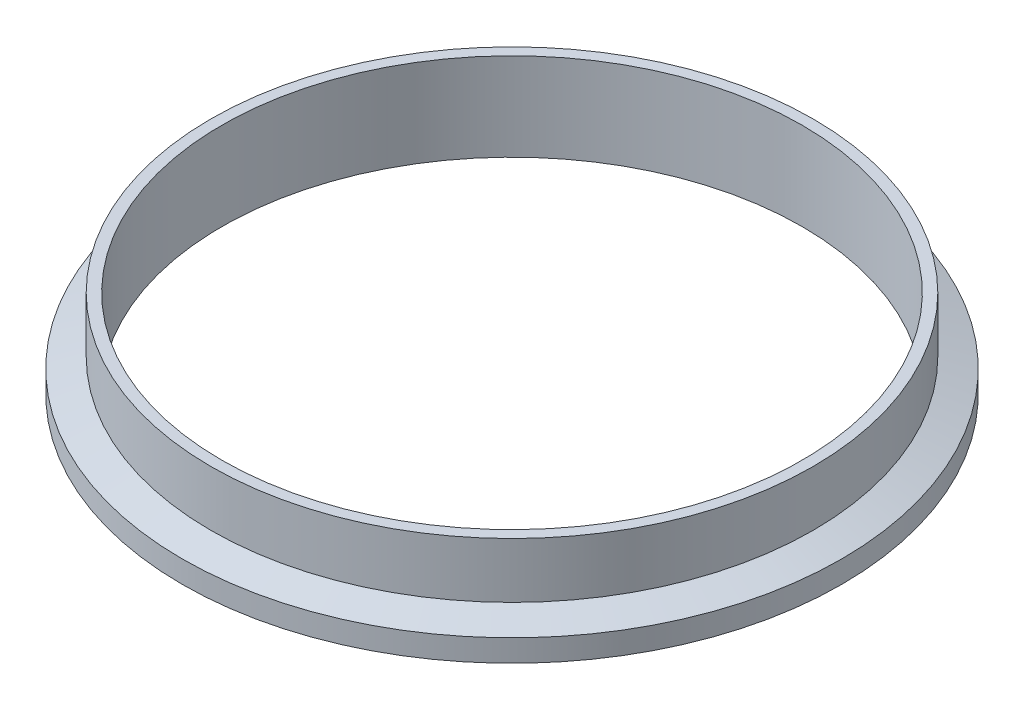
from build123d import *


with BuildPart() as part:
    # Sketch1 → Revolve2 (revolve)
    with BuildSketch(Plane.XY, mode=Mode.PRIVATE) as revolve2_sk:
        with BuildLine():
            Line((-73.4314, 0), (-73.4314, 22.225))
            Line((-73.4314, 22.225), (-76.2, 22.225))
            Line((-76.2, 22.225), (-76.2, 8.222780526))
            Line((-76.2, 8.222780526), (-83.439, 5.588))
            Line((-83.439, 5.588), (-83.439, 0))
            Line((-83.439, 0), (-79.999208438, 0))
            ThreePointArc((-79.999208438, 0), (-79.567011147, 0.129217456), (-79.276666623, 0.474458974))
            ThreePointArc((-79.276666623, 0.474458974), (-78.1812, 1.1938), (-77.085733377, 0.474458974))
            ThreePointArc((-77.085733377, 0.474458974), (-76.795388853, 0.129217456), (-76.363191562, 0))
            Line((-76.363191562, 0), (-73.4314, 0))
        make_face()
    revolve(revolve2_sk.sketch.rotate(Axis((0, 0, 0), (0, 1, 0)), 270), axis=Axis((0, 0, 0), (0, 1, 0)))


solid = part.part
